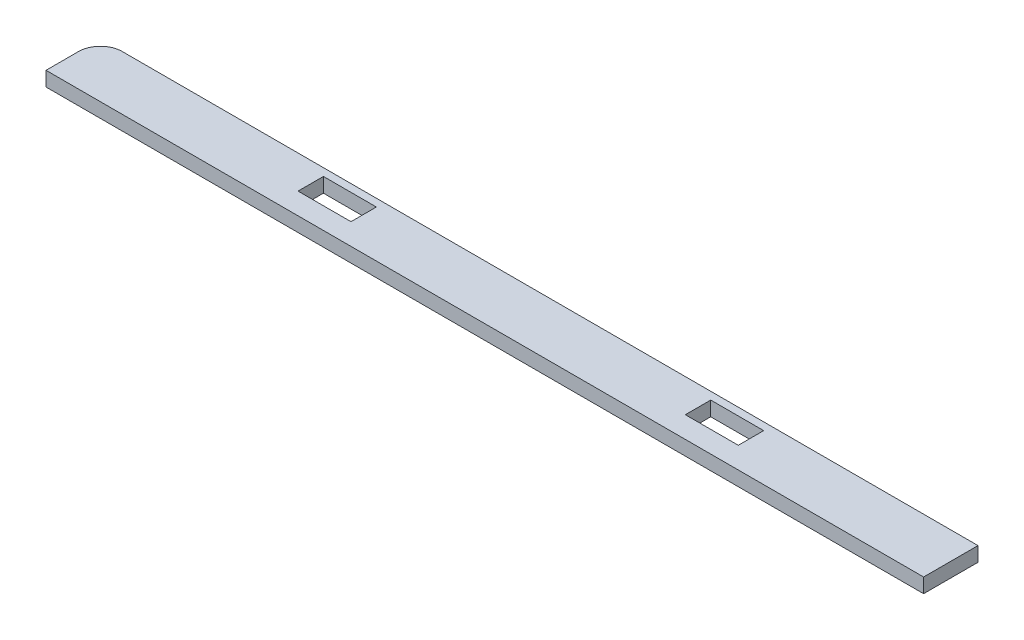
ISO-10303-21;
HEADER;
FILE_DESCRIPTION(('STEP AP214'),'2;1');
FILE_NAME('part.step','',(''),(''),'','','');
FILE_SCHEMA(('AUTOMOTIVE_DESIGN { 1 0 10303 214 1 1 1 1 }'));
ENDSEC;
DATA;
#1=APPLICATION_CONTEXT('core data for automotive mechanical design processes');
#2=APPLICATION_PROTOCOL_DEFINITION('international standard','automotive_design',2000,#1);
#3=PRODUCT_CONTEXT('',#1,'mechanical');
#4=PRODUCT('Part','Part','',(#3));
#5=PRODUCT_RELATED_PRODUCT_CATEGORY('part','',(#4));
#6=PRODUCT_DEFINITION_FORMATION('','',#4);
#7=PRODUCT_DEFINITION_CONTEXT('part definition',#1,'design');
#8=PRODUCT_DEFINITION('design','',#6,#7);
#9=PRODUCT_DEFINITION_SHAPE('','',#8);
#10=(LENGTH_UNIT() NAMED_UNIT(*) SI_UNIT(.MILLI.,.METRE.));
#11=(NAMED_UNIT(*) PLANE_ANGLE_UNIT() SI_UNIT($,.RADIAN.));
#12=(NAMED_UNIT(*) SI_UNIT($,.STERADIAN.) SOLID_ANGLE_UNIT());
#13=UNCERTAINTY_MEASURE_WITH_UNIT(LENGTH_MEASURE(1.E-05),#10,'distance_accuracy_value','');
#14=(GEOMETRIC_REPRESENTATION_CONTEXT(3) GLOBAL_UNCERTAINTY_ASSIGNED_CONTEXT((#13)) GLOBAL_UNIT_ASSIGNED_CONTEXT((#10,
#11,#12)) REPRESENTATION_CONTEXT('',''));
#15=CARTESIAN_POINT('',(0.,0.,0.));
#16=DIRECTION('',(0.,0.,1.));
#17=DIRECTION('',(1.,0.,0.));
#18=AXIS2_PLACEMENT_3D('',#15,#16,#17);
#19=CARTESIAN_POINT('',(-121.,-1.,-121.));
#20=DIRECTION('',(-1.,0.,0.));
#21=DIRECTION('',(0.,0.,1.));
#22=AXIS2_PLACEMENT_3D('',#19,#20,#21);
#23=PLANE('',#22);
#24=DIRECTION('',(0.,0.,1.));
#25=VECTOR('',#24,1.);
#26=CARTESIAN_POINT('',(-121.,3.,-121.));
#27=LINE('',#26,#25);
#28=CARTESIAN_POINT('',(-121.,3.,-115.));
#29=VERTEX_POINT('',#28);
#30=CARTESIAN_POINT('',(-121.,3.,-106.));
#31=VERTEX_POINT('',#30);
#32=EDGE_CURVE('E205',#29,#31,#27,.T.);
#33=ORIENTED_EDGE('',*,*,#32,.F.);
#34=DIRECTION('',(0.,1.,0.));
#35=VECTOR('',#34,1.);
#36=CARTESIAN_POINT('',(-121.,-1.,-115.));
#37=LINE('',#36,#35);
#38=CARTESIAN_POINT('',(-121.,-1.,-115.));
#39=VERTEX_POINT('',#38);
#40=EDGE_CURVE('E45',#29,#39,#37,.F.);
#41=ORIENTED_EDGE('',*,*,#40,.T.);
#42=DIRECTION('',(0.,0.,1.));
#43=VECTOR('',#42,1.);
#44=CARTESIAN_POINT('',(-121.,-1.,-121.));
#45=LINE('',#44,#43);
#46=CARTESIAN_POINT('',(-121.,-1.,-106.));
#47=VERTEX_POINT('',#46);
#48=EDGE_CURVE('E212',#39,#47,#45,.T.);
#49=ORIENTED_EDGE('',*,*,#48,.T.);
#50=DIRECTION('',(0.,1.,0.));
#51=VECTOR('',#50,1.);
#52=CARTESIAN_POINT('',(-121.,-1.,-106.));
#53=LINE('',#52,#51);
#54=EDGE_CURVE('E173',#47,#31,#53,.T.);
#55=ORIENTED_EDGE('',*,*,#54,.T.);
#56=EDGE_LOOP('',(#33,#41,#49,#55));
#57=FACE_BOUND('',#56,.T.);
#58=ADVANCED_FACE('F37',(#57),#23,.T.);
#59=CARTESIAN_POINT('',(121.,-1.,-121.));
#60=DIRECTION('',(0.,0.,-1.));
#61=DIRECTION('',(-1.,0.,0.));
#62=AXIS2_PLACEMENT_3D('',#59,#60,#61);
#63=PLANE('',#62);
#64=DIRECTION('',(-1.,0.,0.));
#65=VECTOR('',#64,1.);
#66=CARTESIAN_POINT('',(121.,-1.,-121.));
#67=LINE('',#66,#65);
#68=CARTESIAN_POINT('',(121.,-1.,-121.));
#69=VERTEX_POINT('',#68);
#70=CARTESIAN_POINT('',(-115.,-1.,-121.));
#71=VERTEX_POINT('',#70);
#72=EDGE_CURVE('E208',#69,#71,#67,.T.);
#73=ORIENTED_EDGE('',*,*,#72,.T.);
#74=DIRECTION('',(0.,1.,0.));
#75=VECTOR('',#74,1.);
#76=CARTESIAN_POINT('',(-115.,-1.,-121.));
#77=LINE('',#76,#75);
#78=CARTESIAN_POINT('',(-115.,3.,-121.));
#79=VERTEX_POINT('',#78);
#80=EDGE_CURVE('E162',#71,#79,#77,.T.);
#81=ORIENTED_EDGE('',*,*,#80,.T.);
#82=DIRECTION('',(-1.,0.,0.));
#83=VECTOR('',#82,1.);
#84=CARTESIAN_POINT('',(121.,3.,-121.));
#85=LINE('',#84,#83);
#86=CARTESIAN_POINT('',(121.,3.,-121.));
#87=VERTEX_POINT('',#86);
#88=EDGE_CURVE('E196',#87,#79,#85,.T.);
#89=ORIENTED_EDGE('',*,*,#88,.F.);
#90=DIRECTION('',(0.,1.,0.));
#91=VECTOR('',#90,1.);
#92=CARTESIAN_POINT('',(121.,-1.,-121.));
#93=LINE('',#92,#91);
#94=EDGE_CURVE('E191',#69,#87,#93,.T.);
#95=ORIENTED_EDGE('',*,*,#94,.F.);
#96=EDGE_LOOP('',(#73,#81,#89,#95));
#97=FACE_BOUND('',#96,.T.);
#98=ADVANCED_FACE('F263',(#97),#63,.T.);
#99=CARTESIAN_POINT('',(121.,-1.,-106.));
#100=DIRECTION('',(1.,0.,0.));
#101=DIRECTION('',(0.,0.,-1.));
#102=AXIS2_PLACEMENT_3D('',#99,#100,#101);
#103=PLANE('',#102);
#104=DIRECTION('',(0.,0.,-1.));
#105=VECTOR('',#104,1.);
#106=CARTESIAN_POINT('',(121.,3.,-106.));
#107=LINE('',#106,#105);
#108=CARTESIAN_POINT('',(121.,3.,-106.));
#109=VERTEX_POINT('',#108);
#110=EDGE_CURVE('E199',#109,#87,#107,.T.);
#111=ORIENTED_EDGE('',*,*,#110,.F.);
#112=DIRECTION('',(0.,1.,0.));
#113=VECTOR('',#112,1.);
#114=CARTESIAN_POINT('',(121.,-1.,-106.));
#115=LINE('',#114,#113);
#116=CARTESIAN_POINT('',(121.,-1.,-106.));
#117=VERTEX_POINT('',#116);
#118=EDGE_CURVE('E185',#117,#109,#115,.T.);
#119=ORIENTED_EDGE('',*,*,#118,.F.);
#120=DIRECTION('',(0.,0.,-1.));
#121=VECTOR('',#120,1.);
#122=CARTESIAN_POINT('',(121.,-1.,-106.));
#123=LINE('',#122,#121);
#124=EDGE_CURVE('E195',#117,#69,#123,.T.);
#125=ORIENTED_EDGE('',*,*,#124,.T.);
#126=ORIENTED_EDGE('',*,*,#94,.T.);
#127=EDGE_LOOP('',(#111,#119,#125,#126));
#128=FACE_BOUND('',#127,.T.);
#129=ADVANCED_FACE('F267',(#128),#103,.T.);
#130=CARTESIAN_POINT('',(-121.,-1.,-106.));
#131=DIRECTION('',(0.,0.,1.));
#132=DIRECTION('',(1.,0.,0.));
#133=AXIS2_PLACEMENT_3D('',#130,#131,#132);
#134=PLANE('',#133);
#135=DIRECTION('',(1.,0.,0.));
#136=VECTOR('',#135,1.);
#137=CARTESIAN_POINT('',(-121.,3.,-106.));
#138=LINE('',#137,#136);
#139=EDGE_CURVE('E202',#31,#109,#138,.T.);
#140=ORIENTED_EDGE('',*,*,#139,.F.);
#141=ORIENTED_EDGE('',*,*,#54,.F.);
#142=DIRECTION('',(1.,0.,0.));
#143=VECTOR('',#142,1.);
#144=CARTESIAN_POINT('',(-121.,-1.,-106.));
#145=LINE('',#144,#143);
#146=EDGE_CURVE('E186',#47,#117,#145,.T.);
#147=ORIENTED_EDGE('',*,*,#146,.T.);
#148=ORIENTED_EDGE('',*,*,#118,.T.);
#149=EDGE_LOOP('',(#140,#141,#147,#148));
#150=FACE_BOUND('',#149,.T.);
#151=ADVANCED_FACE('F284',(#150),#134,.T.);
#152=CARTESIAN_POINT('',(0.,-1.,0.));
#153=DIRECTION('',(0.,1.,0.));
#154=DIRECTION('',(0.,0.,1.));
#155=AXIS2_PLACEMENT_3D('',#152,#153,#154);
#156=PLANE('',#155);
#157=DIRECTION('',(-1.,0.,0.));
#158=VECTOR('',#157,1.);
#159=CARTESIAN_POINT('',(-57.4000000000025,-1.,-118.900000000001));
#160=LINE('',#159,#158);
#161=CARTESIAN_POINT('',(-42.8000000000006,-1.,-118.900000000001));
#162=VERTEX_POINT('',#161);
#163=CARTESIAN_POINT('',(-57.4000000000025,-1.,-118.900000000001));
#164=VERTEX_POINT('',#163);
#165=EDGE_CURVE('E158',#162,#164,#160,.T.);
#166=ORIENTED_EDGE('',*,*,#165,.T.);
#167=DIRECTION('',(0.,0.,1.));
#168=VECTOR('',#167,1.);
#169=CARTESIAN_POINT('',(-57.4000000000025,-1.,-118.900000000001));
#170=LINE('',#169,#168);
#171=CARTESIAN_POINT('',(-57.4000000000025,-1.,-111.900000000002));
#172=VERTEX_POINT('',#171);
#173=EDGE_CURVE('E156',#164,#172,#170,.T.);
#174=ORIENTED_EDGE('',*,*,#173,.T.);
#175=DIRECTION('',(1.,0.,0.));
#176=VECTOR('',#175,1.);
#177=CARTESIAN_POINT('',(-57.4000000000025,-1.,-111.900000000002));
#178=LINE('',#177,#176);
#179=CARTESIAN_POINT('',(-42.8000000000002,-1.,-111.9));
#180=VERTEX_POINT('',#179);
#181=EDGE_CURVE('E141',#172,#180,#178,.T.);
#182=ORIENTED_EDGE('',*,*,#181,.T.);
#183=DIRECTION('',(0.,0.,-1.));
#184=VECTOR('',#183,1.);
#185=CARTESIAN_POINT('',(-42.8000000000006,-1.,-118.900000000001));
#186=LINE('',#185,#184);
#187=EDGE_CURVE('E129',#180,#162,#186,.T.);
#188=ORIENTED_EDGE('',*,*,#187,.T.);
#189=EDGE_LOOP('',(#166,#174,#182,#188));
#190=FACE_BOUND('',#189,.T.);
#191=DIRECTION('',(-1.,0.,0.));
#192=VECTOR('',#191,1.);
#193=CARTESIAN_POINT('',(49.3999999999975,-1.,-118.900000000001));
#194=LINE('',#193,#192);
#195=CARTESIAN_POINT('',(63.9999999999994,-1.,-118.900000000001));
#196=VERTEX_POINT('',#195);
#197=CARTESIAN_POINT('',(49.3999999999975,-1.,-118.900000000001));
#198=VERTEX_POINT('',#197);
#199=EDGE_CURVE('E140',#196,#198,#194,.T.);
#200=ORIENTED_EDGE('',*,*,#199,.T.);
#201=DIRECTION('',(0.,0.,1.));
#202=VECTOR('',#201,1.);
#203=CARTESIAN_POINT('',(49.3999999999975,-1.,-118.900000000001));
#204=LINE('',#203,#202);
#205=CARTESIAN_POINT('',(49.3999999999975,-1.,-111.900000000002));
#206=VERTEX_POINT('',#205);
#207=EDGE_CURVE('E234',#198,#206,#204,.T.);
#208=ORIENTED_EDGE('',*,*,#207,.T.);
#209=DIRECTION('',(1.,0.,0.));
#210=VECTOR('',#209,1.);
#211=CARTESIAN_POINT('',(49.3999999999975,-1.,-111.900000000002));
#212=LINE('',#211,#210);
#213=CARTESIAN_POINT('',(63.9999999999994,-1.,-111.900000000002));
#214=VERTEX_POINT('',#213);
#215=EDGE_CURVE('E237',#206,#214,#212,.T.);
#216=ORIENTED_EDGE('',*,*,#215,.T.);
#217=DIRECTION('',(0.,0.,-1.));
#218=VECTOR('',#217,1.);
#219=CARTESIAN_POINT('',(63.9999999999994,-1.,-118.900000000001));
#220=LINE('',#219,#218);
#221=EDGE_CURVE('E207',#214,#196,#220,.T.);
#222=ORIENTED_EDGE('',*,*,#221,.T.);
#223=EDGE_LOOP('',(#200,#208,#216,#222));
#224=FACE_BOUND('',#223,.T.);
#225=ORIENTED_EDGE('',*,*,#48,.F.);
#226=CARTESIAN_POINT('',(-115.,-1.,-115.));
#227=DIRECTION('',(0.,1.,0.));
#228=DIRECTION('',(0.,0.,1.));
#229=AXIS2_PLACEMENT_3D('',#226,#227,#228);
#230=CIRCLE('',#229,6.);
#231=EDGE_CURVE('E11',#39,#71,#230,.F.);
#232=ORIENTED_EDGE('',*,*,#231,.T.);
#233=ORIENTED_EDGE('',*,*,#72,.F.);
#234=ORIENTED_EDGE('',*,*,#124,.F.);
#235=ORIENTED_EDGE('',*,*,#146,.F.);
#236=EDGE_LOOP('',(#225,#232,#233,#234,#235));
#237=FACE_BOUND('',#236,.T.);
#238=ADVANCED_FACE('F153',(#190,#224,#237),#156,.F.);
#239=CARTESIAN_POINT('',(0.,3.,0.));
#240=DIRECTION('',(0.,1.,0.));
#241=DIRECTION('',(0.,0.,1.));
#242=AXIS2_PLACEMENT_3D('',#239,#240,#241);
#243=PLANE('',#242);
#244=DIRECTION('',(0.,0.,1.));
#245=VECTOR('',#244,1.);
#246=CARTESIAN_POINT('',(-57.4000000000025,3.,-118.900000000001));
#247=LINE('',#246,#245);
#248=CARTESIAN_POINT('',(-57.4000000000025,3.,-118.900000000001));
#249=VERTEX_POINT('',#248);
#250=CARTESIAN_POINT('',(-57.4000000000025,3.,-111.900000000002));
#251=VERTEX_POINT('',#250);
#252=EDGE_CURVE('E180',#249,#251,#247,.T.);
#253=ORIENTED_EDGE('',*,*,#252,.F.);
#254=DIRECTION('',(-1.,0.,0.));
#255=VECTOR('',#254,1.);
#256=CARTESIAN_POINT('',(-57.4000000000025,3.,-118.900000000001));
#257=LINE('',#256,#255);
#258=CARTESIAN_POINT('',(-42.8000000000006,3.,-118.900000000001));
#259=VERTEX_POINT('',#258);
#260=EDGE_CURVE('E177',#259,#249,#257,.T.);
#261=ORIENTED_EDGE('',*,*,#260,.F.);
#262=DIRECTION('',(0.,0.,-1.));
#263=VECTOR('',#262,1.);
#264=CARTESIAN_POINT('',(-42.8000000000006,3.,-118.900000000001));
#265=LINE('',#264,#263);
#266=CARTESIAN_POINT('',(-42.8000000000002,3.,-111.9));
#267=VERTEX_POINT('',#266);
#268=EDGE_CURVE('E151',#267,#259,#265,.T.);
#269=ORIENTED_EDGE('',*,*,#268,.F.);
#270=DIRECTION('',(1.,0.,0.));
#271=VECTOR('',#270,1.);
#272=CARTESIAN_POINT('',(-57.4000000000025,3.,-111.900000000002));
#273=LINE('',#272,#271);
#274=EDGE_CURVE('E149',#251,#267,#273,.T.);
#275=ORIENTED_EDGE('',*,*,#274,.F.);
#276=EDGE_LOOP('',(#253,#261,#269,#275));
#277=FACE_BOUND('',#276,.T.);
#278=DIRECTION('',(0.,0.,1.));
#279=VECTOR('',#278,1.);
#280=CARTESIAN_POINT('',(49.3999999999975,3.,-118.900000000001));
#281=LINE('',#280,#279);
#282=CARTESIAN_POINT('',(49.3999999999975,3.,-118.900000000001));
#283=VERTEX_POINT('',#282);
#284=CARTESIAN_POINT('',(49.3999999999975,3.,-111.900000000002));
#285=VERTEX_POINT('',#284);
#286=EDGE_CURVE('E198',#283,#285,#281,.T.);
#287=ORIENTED_EDGE('',*,*,#286,.F.);
#288=DIRECTION('',(-1.,0.,0.));
#289=VECTOR('',#288,1.);
#290=CARTESIAN_POINT('',(49.3999999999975,3.,-118.900000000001));
#291=LINE('',#290,#289);
#292=CARTESIAN_POINT('',(63.9999999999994,3.,-118.900000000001));
#293=VERTEX_POINT('',#292);
#294=EDGE_CURVE('E222',#293,#283,#291,.T.);
#295=ORIENTED_EDGE('',*,*,#294,.F.);
#296=DIRECTION('',(0.,0.,-1.));
#297=VECTOR('',#296,1.);
#298=CARTESIAN_POINT('',(63.9999999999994,3.,-118.900000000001));
#299=LINE('',#298,#297);
#300=CARTESIAN_POINT('',(63.9999999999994,3.,-111.900000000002));
#301=VERTEX_POINT('',#300);
#302=EDGE_CURVE('E219',#301,#293,#299,.T.);
#303=ORIENTED_EDGE('',*,*,#302,.F.);
#304=DIRECTION('',(1.,0.,0.));
#305=VECTOR('',#304,1.);
#306=CARTESIAN_POINT('',(49.3999999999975,3.,-111.900000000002));
#307=LINE('',#306,#305);
#308=EDGE_CURVE('E216',#285,#301,#307,.T.);
#309=ORIENTED_EDGE('',*,*,#308,.F.);
#310=EDGE_LOOP('',(#287,#295,#303,#309));
#311=FACE_BOUND('',#310,.T.);
#312=ORIENTED_EDGE('',*,*,#88,.T.);
#313=CARTESIAN_POINT('',(-115.,3.,-115.));
#314=DIRECTION('',(0.,1.,0.));
#315=DIRECTION('',(0.,0.,1.));
#316=AXIS2_PLACEMENT_3D('',#313,#314,#315);
#317=CIRCLE('',#316,6.);
#318=EDGE_CURVE('E59',#79,#29,#317,.T.);
#319=ORIENTED_EDGE('',*,*,#318,.T.);
#320=ORIENTED_EDGE('',*,*,#32,.T.);
#321=ORIENTED_EDGE('',*,*,#139,.T.);
#322=ORIENTED_EDGE('',*,*,#110,.T.);
#323=EDGE_LOOP('',(#312,#319,#320,#321,#322));
#324=FACE_BOUND('',#323,.T.);
#325=ADVANCED_FACE('F259',(#277,#311,#324),#243,.T.);
#326=CARTESIAN_POINT('',(49.3999999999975,-1.,-118.900000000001));
#327=DIRECTION('',(-1.,0.,0.));
#328=DIRECTION('',(0.,0.,1.));
#329=AXIS2_PLACEMENT_3D('',#326,#327,#328);
#330=PLANE('',#329);
#331=ORIENTED_EDGE('',*,*,#286,.T.);
#332=DIRECTION('',(0.,1.,0.));
#333=VECTOR('',#332,1.);
#334=CARTESIAN_POINT('',(49.3999999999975,-1.,-111.900000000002));
#335=LINE('',#334,#333);
#336=EDGE_CURVE('E184',#206,#285,#335,.T.);
#337=ORIENTED_EDGE('',*,*,#336,.F.);
#338=ORIENTED_EDGE('',*,*,#207,.F.);
#339=DIRECTION('',(0.,1.,0.));
#340=VECTOR('',#339,1.);
#341=CARTESIAN_POINT('',(49.3999999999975,-1.,-118.900000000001));
#342=LINE('',#341,#340);
#343=EDGE_CURVE('E223',#198,#283,#342,.T.);
#344=ORIENTED_EDGE('',*,*,#343,.T.);
#345=EDGE_LOOP('',(#331,#337,#338,#344));
#346=FACE_BOUND('',#345,.T.);
#347=ADVANCED_FACE('F246',(#346),#330,.F.);
#348=CARTESIAN_POINT('',(49.3999999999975,-1.,-118.900000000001));
#349=DIRECTION('',(0.,0.,-1.));
#350=DIRECTION('',(-1.,0.,0.));
#351=AXIS2_PLACEMENT_3D('',#348,#349,#350);
#352=PLANE('',#351);
#353=ORIENTED_EDGE('',*,*,#294,.T.);
#354=ORIENTED_EDGE('',*,*,#343,.F.);
#355=ORIENTED_EDGE('',*,*,#199,.F.);
#356=DIRECTION('',(0.,1.,0.));
#357=VECTOR('',#356,1.);
#358=CARTESIAN_POINT('',(63.9999999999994,-1.,-118.900000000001));
#359=LINE('',#358,#357);
#360=EDGE_CURVE('E220',#196,#293,#359,.T.);
#361=ORIENTED_EDGE('',*,*,#360,.T.);
#362=EDGE_LOOP('',(#353,#354,#355,#361));
#363=FACE_BOUND('',#362,.T.);
#364=ADVANCED_FACE('F257',(#363),#352,.F.);
#365=CARTESIAN_POINT('',(63.9999999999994,-1.,-118.900000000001));
#366=DIRECTION('',(1.,0.,0.));
#367=DIRECTION('',(0.,0.,-1.));
#368=AXIS2_PLACEMENT_3D('',#365,#366,#367);
#369=PLANE('',#368);
#370=ORIENTED_EDGE('',*,*,#302,.T.);
#371=ORIENTED_EDGE('',*,*,#360,.F.);
#372=ORIENTED_EDGE('',*,*,#221,.F.);
#373=DIRECTION('',(0.,1.,0.));
#374=VECTOR('',#373,1.);
#375=CARTESIAN_POINT('',(63.9999999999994,-1.,-111.900000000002));
#376=LINE('',#375,#374);
#377=EDGE_CURVE('E217',#214,#301,#376,.T.);
#378=ORIENTED_EDGE('',*,*,#377,.T.);
#379=EDGE_LOOP('',(#370,#371,#372,#378));
#380=FACE_BOUND('',#379,.T.);
#381=ADVANCED_FACE('F254',(#380),#369,.F.);
#382=CARTESIAN_POINT('',(49.3999999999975,-1.,-111.900000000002));
#383=DIRECTION('',(0.,0.,1.));
#384=DIRECTION('',(1.,0.,0.));
#385=AXIS2_PLACEMENT_3D('',#382,#383,#384);
#386=PLANE('',#385);
#387=ORIENTED_EDGE('',*,*,#308,.T.);
#388=ORIENTED_EDGE('',*,*,#377,.F.);
#389=ORIENTED_EDGE('',*,*,#215,.F.);
#390=ORIENTED_EDGE('',*,*,#336,.T.);
#391=EDGE_LOOP('',(#387,#388,#389,#390));
#392=FACE_BOUND('',#391,.T.);
#393=ADVANCED_FACE('F251',(#392),#386,.F.);
#394=CARTESIAN_POINT('',(-57.4000000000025,-1.,-118.900000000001));
#395=DIRECTION('',(-1.,0.,0.));
#396=DIRECTION('',(0.,0.,1.));
#397=AXIS2_PLACEMENT_3D('',#394,#395,#396);
#398=PLANE('',#397);
#399=ORIENTED_EDGE('',*,*,#252,.T.);
#400=DIRECTION('',(0.,1.,0.));
#401=VECTOR('',#400,1.);
#402=CARTESIAN_POINT('',(-57.4000000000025,-1.,-111.900000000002));
#403=LINE('',#402,#401);
#404=EDGE_CURVE('E165',#172,#251,#403,.T.);
#405=ORIENTED_EDGE('',*,*,#404,.F.);
#406=ORIENTED_EDGE('',*,*,#173,.F.);
#407=DIRECTION('',(0.,1.,0.));
#408=VECTOR('',#407,1.);
#409=CARTESIAN_POINT('',(-57.4000000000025,-1.,-118.900000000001));
#410=LINE('',#409,#408);
#411=EDGE_CURVE('E178',#164,#249,#410,.T.);
#412=ORIENTED_EDGE('',*,*,#411,.T.);
#413=EDGE_LOOP('',(#399,#405,#406,#412));
#414=FACE_BOUND('',#413,.T.);
#415=ADVANCED_FACE('F286',(#414),#398,.F.);
#416=CARTESIAN_POINT('',(-57.4000000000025,-1.,-118.900000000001));
#417=DIRECTION('',(0.,0.,-1.));
#418=DIRECTION('',(-1.,0.,0.));
#419=AXIS2_PLACEMENT_3D('',#416,#417,#418);
#420=PLANE('',#419);
#421=ORIENTED_EDGE('',*,*,#260,.T.);
#422=ORIENTED_EDGE('',*,*,#411,.F.);
#423=ORIENTED_EDGE('',*,*,#165,.F.);
#424=DIRECTION('',(0.,1.,0.));
#425=VECTOR('',#424,1.);
#426=CARTESIAN_POINT('',(-42.8000000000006,-1.,-118.900000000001));
#427=LINE('',#426,#425);
#428=EDGE_CURVE('E135',#162,#259,#427,.T.);
#429=ORIENTED_EDGE('',*,*,#428,.T.);
#430=EDGE_LOOP('',(#421,#422,#423,#429));
#431=FACE_BOUND('',#430,.T.);
#432=ADVANCED_FACE('F288',(#431),#420,.F.);
#433=CARTESIAN_POINT('',(-42.8000000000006,-1.,-118.900000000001));
#434=DIRECTION('',(1.,0.,0.));
#435=DIRECTION('',(0.,0.,-1.));
#436=AXIS2_PLACEMENT_3D('',#433,#434,#435);
#437=PLANE('',#436);
#438=ORIENTED_EDGE('',*,*,#268,.T.);
#439=ORIENTED_EDGE('',*,*,#428,.F.);
#440=ORIENTED_EDGE('',*,*,#187,.F.);
#441=DIRECTION('',(0.,1.,0.));
#442=VECTOR('',#441,1.);
#443=CARTESIAN_POINT('',(-42.8000000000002,-1.,-111.9));
#444=LINE('',#443,#442);
#445=EDGE_CURVE('E133',#180,#267,#444,.T.);
#446=ORIENTED_EDGE('',*,*,#445,.T.);
#447=EDGE_LOOP('',(#438,#439,#440,#446));
#448=FACE_BOUND('',#447,.T.);
#449=ADVANCED_FACE('F132',(#448),#437,.F.);
#450=CARTESIAN_POINT('',(-57.4000000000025,-1.,-111.900000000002));
#451=DIRECTION('',(0.,0.,1.));
#452=DIRECTION('',(1.,0.,0.));
#453=AXIS2_PLACEMENT_3D('',#450,#451,#452);
#454=PLANE('',#453);
#455=ORIENTED_EDGE('',*,*,#274,.T.);
#456=ORIENTED_EDGE('',*,*,#445,.F.);
#457=ORIENTED_EDGE('',*,*,#181,.F.);
#458=ORIENTED_EDGE('',*,*,#404,.T.);
#459=EDGE_LOOP('',(#455,#456,#457,#458));
#460=FACE_BOUND('',#459,.T.);
#461=ADVANCED_FACE('F145',(#460),#454,.F.);
#462=CARTESIAN_POINT('',(-115.,-1.,-115.));
#463=DIRECTION('',(0.,1.,0.));
#464=DIRECTION('',(0.,0.,1.));
#465=AXIS2_PLACEMENT_3D('',#462,#463,#464);
#466=CYLINDRICAL_SURFACE('',#465,6.);
#467=ORIENTED_EDGE('',*,*,#231,.F.);
#468=ORIENTED_EDGE('',*,*,#40,.F.);
#469=ORIENTED_EDGE('',*,*,#318,.F.);
#470=ORIENTED_EDGE('',*,*,#80,.F.);
#471=EDGE_LOOP('',(#467,#468,#469,#470));
#472=FACE_BOUND('',#471,.T.);
#473=ADVANCED_FACE('F39',(#472),#466,.T.);
#474=CLOSED_SHELL('',(#58,#98,#129,#151,#238,#325,#347,#364,#381,#393,#415,#432,#449,#461,#473));
#475=MANIFOLD_SOLID_BREP('B2',#474);
#476=ADVANCED_BREP_SHAPE_REPRESENTATION('',(#18,#475),#14);
#477=SHAPE_DEFINITION_REPRESENTATION(#9,#476);
ENDSEC;
END-ISO-10303-21;
